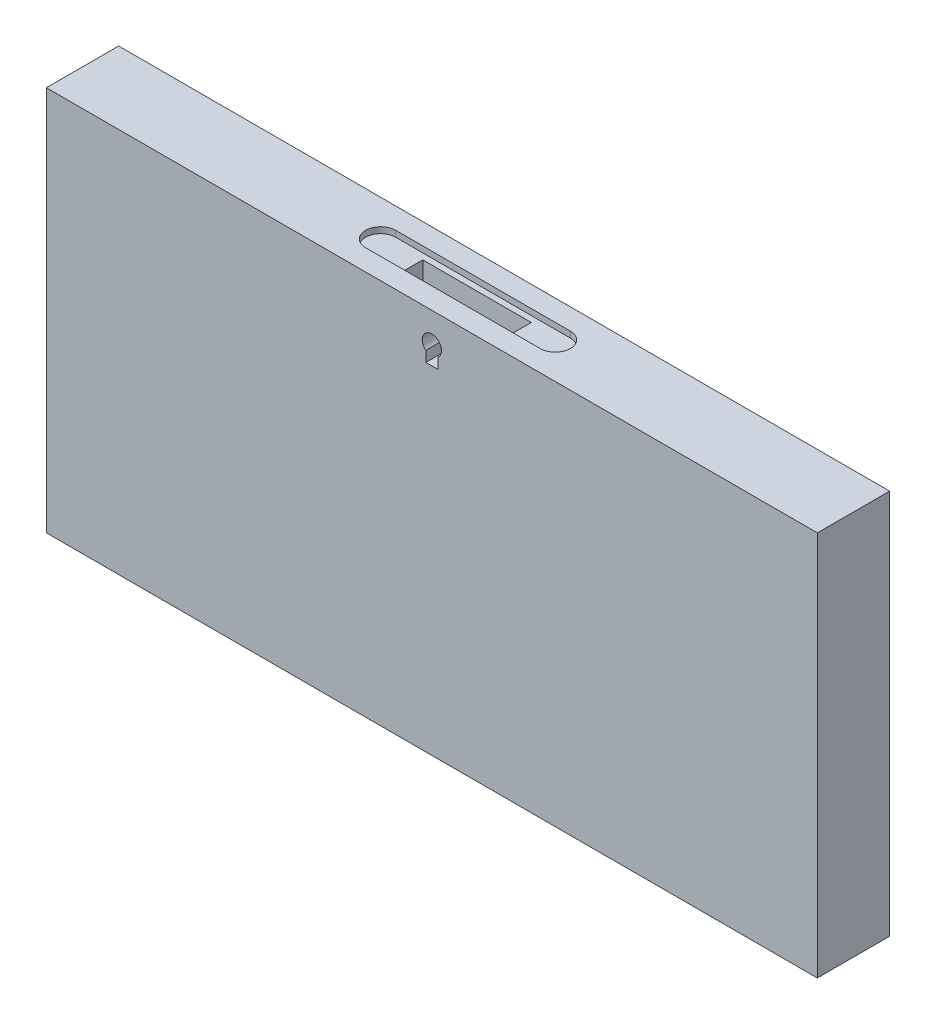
ISO-10303-21;
HEADER;
FILE_DESCRIPTION(('STEP AP214'),'2;1');
FILE_NAME('part.step','',(''),(''),'','','');
FILE_SCHEMA(('AUTOMOTIVE_DESIGN { 1 0 10303 214 1 1 1 1 }'));
ENDSEC;
DATA;
#1=APPLICATION_CONTEXT('core data for automotive mechanical design processes');
#2=APPLICATION_PROTOCOL_DEFINITION('international standard','automotive_design',2000,#1);
#3=PRODUCT_CONTEXT('',#1,'mechanical');
#4=PRODUCT('Part','Part','',(#3));
#5=PRODUCT_RELATED_PRODUCT_CATEGORY('part','',(#4));
#6=PRODUCT_DEFINITION_FORMATION('','',#4);
#7=PRODUCT_DEFINITION_CONTEXT('part definition',#1,'design');
#8=PRODUCT_DEFINITION('design','',#6,#7);
#9=PRODUCT_DEFINITION_SHAPE('','',#8);
#10=(LENGTH_UNIT() NAMED_UNIT(*) SI_UNIT(.MILLI.,.METRE.));
#11=(NAMED_UNIT(*) PLANE_ANGLE_UNIT() SI_UNIT($,.RADIAN.));
#12=(NAMED_UNIT(*) SI_UNIT($,.STERADIAN.) SOLID_ANGLE_UNIT());
#13=UNCERTAINTY_MEASURE_WITH_UNIT(LENGTH_MEASURE(1.E-05),#10,'distance_accuracy_value','');
#14=(GEOMETRIC_REPRESENTATION_CONTEXT(3) GLOBAL_UNCERTAINTY_ASSIGNED_CONTEXT((#13)) GLOBAL_UNIT_ASSIGNED_CONTEXT((#10,
#11,#12)) REPRESENTATION_CONTEXT('',''));
#15=CARTESIAN_POINT('',(0.,0.,0.));
#16=DIRECTION('',(0.,0.,1.));
#17=DIRECTION('',(1.,0.,0.));
#18=AXIS2_PLACEMENT_3D('',#15,#16,#17);
#19=CARTESIAN_POINT('',(0.,-101.6,0.));
#20=DIRECTION('',(-1.,0.,0.));
#21=DIRECTION('',(0.,0.,1.));
#22=AXIS2_PLACEMENT_3D('',#19,#20,#21);
#23=PLANE('',#22);
#24=DIRECTION('',(0.,0.,1.));
#25=VECTOR('',#24,1.);
#26=CARTESIAN_POINT('',(0.,0.,0.));
#27=LINE('',#26,#25);
#28=CARTESIAN_POINT('',(0.,0.,-19.05));
#29=VERTEX_POINT('',#28);
#30=CARTESIAN_POINT('',(0.,0.,0.));
#31=VERTEX_POINT('',#30);
#32=EDGE_CURVE('E229',#29,#31,#27,.T.);
#33=ORIENTED_EDGE('',*,*,#32,.F.);
#34=DIRECTION('',(0.,1.,0.));
#35=VECTOR('',#34,1.);
#36=CARTESIAN_POINT('',(0.,-101.6,-19.05));
#37=LINE('',#36,#35);
#38=CARTESIAN_POINT('',(0.,-101.6,-19.05));
#39=VERTEX_POINT('',#38);
#40=EDGE_CURVE('E260',#39,#29,#37,.T.);
#41=ORIENTED_EDGE('',*,*,#40,.F.);
#42=DIRECTION('',(0.,0.,1.));
#43=VECTOR('',#42,1.);
#44=CARTESIAN_POINT('',(0.,-101.6,0.));
#45=LINE('',#44,#43);
#46=CARTESIAN_POINT('',(0.,-101.6,0.));
#47=VERTEX_POINT('',#46);
#48=EDGE_CURVE('E236',#39,#47,#45,.T.);
#49=ORIENTED_EDGE('',*,*,#48,.T.);
#50=DIRECTION('',(0.,1.,0.));
#51=VECTOR('',#50,1.);
#52=CARTESIAN_POINT('',(0.,-101.6,0.));
#53=LINE('',#52,#51);
#54=EDGE_CURVE('E249',#47,#31,#53,.T.);
#55=ORIENTED_EDGE('',*,*,#54,.T.);
#56=EDGE_LOOP('',(#33,#41,#49,#55));
#57=FACE_BOUND('',#56,.T.);
#58=ADVANCED_FACE('F32',(#57),#23,.T.);
#59=CARTESIAN_POINT('',(0.,-101.6,-19.05));
#60=DIRECTION('',(0.,0.,-1.));
#61=DIRECTION('',(-1.,0.,0.));
#62=AXIS2_PLACEMENT_3D('',#59,#60,#61);
#63=PLANE('',#62);
#64=DIRECTION('',(-1.,0.,0.));
#65=VECTOR('',#64,1.);
#66=CARTESIAN_POINT('',(0.,0.,-19.05));
#67=LINE('',#66,#65);
#68=CARTESIAN_POINT('',(203.2,0.,-19.05));
#69=VERTEX_POINT('',#68);
#70=EDGE_CURVE('E240',#69,#29,#67,.T.);
#71=ORIENTED_EDGE('',*,*,#70,.F.);
#72=DIRECTION('',(0.,1.,0.));
#73=VECTOR('',#72,1.);
#74=CARTESIAN_POINT('',(203.2,-101.6,-19.05));
#75=LINE('',#74,#73);
#76=CARTESIAN_POINT('',(203.2,-101.6,-19.05));
#77=VERTEX_POINT('',#76);
#78=EDGE_CURVE('E263',#77,#69,#75,.T.);
#79=ORIENTED_EDGE('',*,*,#78,.F.);
#80=DIRECTION('',(-1.,0.,0.));
#81=VECTOR('',#80,1.);
#82=CARTESIAN_POINT('',(0.,-101.6,-19.05));
#83=LINE('',#82,#81);
#84=EDGE_CURVE('E246',#77,#39,#83,.T.);
#85=ORIENTED_EDGE('',*,*,#84,.T.);
#86=ORIENTED_EDGE('',*,*,#40,.T.);
#87=EDGE_LOOP('',(#71,#79,#85,#86));
#88=FACE_BOUND('',#87,.T.);
#89=ADVANCED_FACE('F290',(#88),#63,.T.);
#90=CARTESIAN_POINT('',(203.2,-101.6,0.));
#91=DIRECTION('',(1.,0.,0.));
#92=DIRECTION('',(0.,0.,-1.));
#93=AXIS2_PLACEMENT_3D('',#90,#91,#92);
#94=PLANE('',#93);
#95=DIRECTION('',(0.,0.,-1.));
#96=VECTOR('',#95,1.);
#97=CARTESIAN_POINT('',(203.2,0.,0.));
#98=LINE('',#97,#96);
#99=CARTESIAN_POINT('',(203.2,0.,0.));
#100=VERTEX_POINT('',#99);
#101=EDGE_CURVE('E255',#100,#69,#98,.T.);
#102=ORIENTED_EDGE('',*,*,#101,.F.);
#103=DIRECTION('',(0.,1.,0.));
#104=VECTOR('',#103,1.);
#105=CARTESIAN_POINT('',(203.2,-101.6,0.));
#106=LINE('',#105,#104);
#107=CARTESIAN_POINT('',(203.2,-101.6,0.));
#108=VERTEX_POINT('',#107);
#109=EDGE_CURVE('E265',#108,#100,#106,.T.);
#110=ORIENTED_EDGE('',*,*,#109,.F.);
#111=DIRECTION('',(0.,0.,-1.));
#112=VECTOR('',#111,1.);
#113=CARTESIAN_POINT('',(203.2,-101.6,0.));
#114=LINE('',#113,#112);
#115=EDGE_CURVE('E243',#108,#77,#114,.T.);
#116=ORIENTED_EDGE('',*,*,#115,.T.);
#117=ORIENTED_EDGE('',*,*,#78,.T.);
#118=EDGE_LOOP('',(#102,#110,#116,#117));
#119=FACE_BOUND('',#118,.T.);
#120=ADVANCED_FACE('F295',(#119),#94,.T.);
#121=CARTESIAN_POINT('',(0.,-101.6,0.));
#122=DIRECTION('',(0.,0.,1.));
#123=DIRECTION('',(1.,0.,0.));
#124=AXIS2_PLACEMENT_3D('',#121,#122,#123);
#125=PLANE('',#124);
#126=DIRECTION('',(0.,-1.,0.));
#127=VECTOR('',#126,1.);
#128=CARTESIAN_POINT('',(100.0125,-9.92028686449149,0.));
#129=LINE('',#128,#127);
#130=CARTESIAN_POINT('',(100.0125,-9.92028686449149,0.));
#131=VERTEX_POINT('',#130);
#132=CARTESIAN_POINT('',(100.0125,-12.7,0.));
#133=VERTEX_POINT('',#132);
#134=EDGE_CURVE('E162',#131,#133,#129,.T.);
#135=ORIENTED_EDGE('',*,*,#134,.F.);
#136=CARTESIAN_POINT('',(101.6,-7.9375,0.));
#137=DIRECTION('',(0.,0.,1.));
#138=DIRECTION('',(1.,0.,0.));
#139=AXIS2_PLACEMENT_3D('',#136,#137,#138);
#140=CIRCLE('',#139,2.54);
#141=CARTESIAN_POINT('',(103.1875,-9.92028686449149,0.));
#142=VERTEX_POINT('',#141);
#143=EDGE_CURVE('E147',#142,#131,#140,.T.);
#144=ORIENTED_EDGE('',*,*,#143,.F.);
#145=DIRECTION('',(0.,1.,0.));
#146=VECTOR('',#145,1.);
#147=CARTESIAN_POINT('',(103.1875,-12.7,0.));
#148=LINE('',#147,#146);
#149=CARTESIAN_POINT('',(103.1875,-12.7,0.));
#150=VERTEX_POINT('',#149);
#151=EDGE_CURVE('E155',#150,#142,#148,.T.);
#152=ORIENTED_EDGE('',*,*,#151,.F.);
#153=DIRECTION('',(1.,0.,0.));
#154=VECTOR('',#153,1.);
#155=CARTESIAN_POINT('',(100.0125,-12.7,0.));
#156=LINE('',#155,#154);
#157=EDGE_CURVE('E46',#133,#150,#156,.T.);
#158=ORIENTED_EDGE('',*,*,#157,.F.);
#159=EDGE_LOOP('',(#135,#144,#152,#158));
#160=FACE_BOUND('',#159,.T.);
#161=DIRECTION('',(1.,0.,0.));
#162=VECTOR('',#161,1.);
#163=CARTESIAN_POINT('',(0.,0.,0.));
#164=LINE('',#163,#162);
#165=EDGE_CURVE('E252',#31,#100,#164,.T.);
#166=ORIENTED_EDGE('',*,*,#165,.F.);
#167=ORIENTED_EDGE('',*,*,#54,.F.);
#168=DIRECTION('',(1.,0.,0.));
#169=VECTOR('',#168,1.);
#170=CARTESIAN_POINT('',(0.,-101.6,0.));
#171=LINE('',#170,#169);
#172=EDGE_CURVE('E239',#47,#108,#171,.T.);
#173=ORIENTED_EDGE('',*,*,#172,.T.);
#174=ORIENTED_EDGE('',*,*,#109,.T.);
#175=EDGE_LOOP('',(#166,#167,#173,#174));
#176=FACE_BOUND('',#175,.T.);
#177=ADVANCED_FACE('F159',(#160,#176),#125,.T.);
#178=CARTESIAN_POINT('',(0.,-101.6,-19.05));
#179=DIRECTION('',(0.,-1.,0.));
#180=DIRECTION('',(0.,0.,-1.));
#181=AXIS2_PLACEMENT_3D('',#178,#179,#180);
#182=PLANE('',#181);
#183=ORIENTED_EDGE('',*,*,#48,.F.);
#184=ORIENTED_EDGE('',*,*,#84,.F.);
#185=ORIENTED_EDGE('',*,*,#115,.F.);
#186=ORIENTED_EDGE('',*,*,#172,.F.);
#187=EDGE_LOOP('',(#183,#184,#185,#186));
#188=FACE_BOUND('',#187,.T.);
#189=ADVANCED_FACE('F308',(#188),#182,.T.);
#190=CARTESIAN_POINT('',(0.,0.,-19.05));
#191=DIRECTION('',(0.,-1.,0.));
#192=DIRECTION('',(0.,0.,-1.));
#193=AXIS2_PLACEMENT_3D('',#190,#191,#192);
#194=PLANE('',#193);
#195=DIRECTION('',(1.,0.,0.));
#196=VECTOR('',#195,1.);
#197=CARTESIAN_POINT('',(78.58125,0.,-5.55625));
#198=LINE('',#197,#196);
#199=CARTESIAN_POINT('',(78.58125,0.,-5.55625));
#200=VERTEX_POINT('',#199);
#201=CARTESIAN_POINT('',(124.61875,0.,-5.55625));
#202=VERTEX_POINT('',#201);
#203=EDGE_CURVE('E219',#200,#202,#198,.T.);
#204=ORIENTED_EDGE('',*,*,#203,.F.);
#205=CARTESIAN_POINT('',(78.58125,0.,-9.525));
#206=DIRECTION('',(0.,1.,0.));
#207=DIRECTION('',(0.,0.,1.));
#208=AXIS2_PLACEMENT_3D('',#205,#206,#207);
#209=CIRCLE('',#208,3.96875);
#210=CARTESIAN_POINT('',(78.58125,0.,-13.49375));
#211=VERTEX_POINT('',#210);
#212=EDGE_CURVE('E197',#211,#200,#209,.T.);
#213=ORIENTED_EDGE('',*,*,#212,.F.);
#214=DIRECTION('',(-1.,0.,0.));
#215=VECTOR('',#214,1.);
#216=CARTESIAN_POINT('',(124.61875,0.,-13.49375));
#217=LINE('',#216,#215);
#218=CARTESIAN_POINT('',(124.61875,0.,-13.49375));
#219=VERTEX_POINT('',#218);
#220=EDGE_CURVE('E208',#219,#211,#217,.T.);
#221=ORIENTED_EDGE('',*,*,#220,.F.);
#222=CARTESIAN_POINT('',(124.61875,0.,-9.525));
#223=DIRECTION('',(0.,1.,0.));
#224=DIRECTION('',(0.,0.,1.));
#225=AXIS2_PLACEMENT_3D('',#222,#223,#224);
#226=CIRCLE('',#225,3.96875);
#227=EDGE_CURVE('E222',#202,#219,#226,.T.);
#228=ORIENTED_EDGE('',*,*,#227,.F.);
#229=EDGE_LOOP('',(#204,#213,#221,#228));
#230=FACE_BOUND('',#229,.T.);
#231=ORIENTED_EDGE('',*,*,#32,.T.);
#232=ORIENTED_EDGE('',*,*,#165,.T.);
#233=ORIENTED_EDGE('',*,*,#101,.T.);
#234=ORIENTED_EDGE('',*,*,#70,.T.);
#235=EDGE_LOOP('',(#231,#232,#233,#234));
#236=FACE_BOUND('',#235,.T.);
#237=ADVANCED_FACE('F303',(#230,#236),#194,.F.);
#238=CARTESIAN_POINT('',(78.58125,-1.5875,-9.525));
#239=DIRECTION('',(0.,1.,0.));
#240=DIRECTION('',(0.,0.,1.));
#241=AXIS2_PLACEMENT_3D('',#238,#239,#240);
#242=CYLINDRICAL_SURFACE('',#241,3.96875);
#243=ORIENTED_EDGE('',*,*,#212,.T.);
#244=DIRECTION('',(0.,1.,0.));
#245=VECTOR('',#244,1.);
#246=CARTESIAN_POINT('',(78.58125,-1.5875,-5.55625));
#247=LINE('',#246,#245);
#248=CARTESIAN_POINT('',(78.58125,-1.5875,-5.55625));
#249=VERTEX_POINT('',#248);
#250=EDGE_CURVE('E217',#249,#200,#247,.T.);
#251=ORIENTED_EDGE('',*,*,#250,.F.);
#252=CARTESIAN_POINT('',(78.58125,-1.5875,-9.525));
#253=DIRECTION('',(0.,1.,0.));
#254=DIRECTION('',(0.,0.,1.));
#255=AXIS2_PLACEMENT_3D('',#252,#253,#254);
#256=CIRCLE('',#255,3.96875);
#257=CARTESIAN_POINT('',(78.58125,-1.5875,-13.49375));
#258=VERTEX_POINT('',#257);
#259=EDGE_CURVE('E204',#258,#249,#256,.T.);
#260=ORIENTED_EDGE('',*,*,#259,.F.);
#261=DIRECTION('',(0.,1.,0.));
#262=VECTOR('',#261,1.);
#263=CARTESIAN_POINT('',(78.58125,-1.5875,-13.49375));
#264=LINE('',#263,#262);
#265=EDGE_CURVE('E227',#258,#211,#264,.T.);
#266=ORIENTED_EDGE('',*,*,#265,.T.);
#267=EDGE_LOOP('',(#243,#251,#260,#266));
#268=FACE_BOUND('',#267,.T.);
#269=ADVANCED_FACE('F319',(#268),#242,.F.);
#270=CARTESIAN_POINT('',(124.61875,-1.5875,-13.49375));
#271=DIRECTION('',(0.,0.,-1.));
#272=DIRECTION('',(-1.,0.,0.));
#273=AXIS2_PLACEMENT_3D('',#270,#271,#272);
#274=PLANE('',#273);
#275=ORIENTED_EDGE('',*,*,#220,.T.);
#276=ORIENTED_EDGE('',*,*,#265,.F.);
#277=DIRECTION('',(-1.,0.,0.));
#278=VECTOR('',#277,1.);
#279=CARTESIAN_POINT('',(124.61875,-1.5875,-13.49375));
#280=LINE('',#279,#278);
#281=CARTESIAN_POINT('',(124.61875,-1.5875,-13.49375));
#282=VERTEX_POINT('',#281);
#283=EDGE_CURVE('E214',#282,#258,#280,.T.);
#284=ORIENTED_EDGE('',*,*,#283,.F.);
#285=DIRECTION('',(0.,1.,0.));
#286=VECTOR('',#285,1.);
#287=CARTESIAN_POINT('',(124.61875,-1.5875,-13.49375));
#288=LINE('',#287,#286);
#289=EDGE_CURVE('E230',#282,#219,#288,.T.);
#290=ORIENTED_EDGE('',*,*,#289,.T.);
#291=EDGE_LOOP('',(#275,#276,#284,#290));
#292=FACE_BOUND('',#291,.T.);
#293=ADVANCED_FACE('F325',(#292),#274,.F.);
#294=CARTESIAN_POINT('',(124.61875,-1.5875,-9.525));
#295=DIRECTION('',(0.,1.,0.));
#296=DIRECTION('',(0.,0.,1.));
#297=AXIS2_PLACEMENT_3D('',#294,#295,#296);
#298=CYLINDRICAL_SURFACE('',#297,3.96875);
#299=ORIENTED_EDGE('',*,*,#227,.T.);
#300=ORIENTED_EDGE('',*,*,#289,.F.);
#301=CARTESIAN_POINT('',(124.61875,-1.5875,-9.525));
#302=DIRECTION('',(0.,1.,0.));
#303=DIRECTION('',(0.,0.,1.));
#304=AXIS2_PLACEMENT_3D('',#301,#302,#303);
#305=CIRCLE('',#304,3.96875);
#306=CARTESIAN_POINT('',(124.61875,-1.5875,-5.55625));
#307=VERTEX_POINT('',#306);
#308=EDGE_CURVE('E211',#307,#282,#305,.T.);
#309=ORIENTED_EDGE('',*,*,#308,.F.);
#310=DIRECTION('',(0.,1.,0.));
#311=VECTOR('',#310,1.);
#312=CARTESIAN_POINT('',(124.61875,-1.5875,-5.55625));
#313=LINE('',#312,#311);
#314=EDGE_CURVE('E232',#307,#202,#313,.T.);
#315=ORIENTED_EDGE('',*,*,#314,.T.);
#316=EDGE_LOOP('',(#299,#300,#309,#315));
#317=FACE_BOUND('',#316,.T.);
#318=ADVANCED_FACE('F331',(#317),#298,.F.);
#319=CARTESIAN_POINT('',(78.58125,-1.5875,-5.55625));
#320=DIRECTION('',(0.,0.,1.));
#321=DIRECTION('',(1.,0.,0.));
#322=AXIS2_PLACEMENT_3D('',#319,#320,#321);
#323=PLANE('',#322);
#324=ORIENTED_EDGE('',*,*,#203,.T.);
#325=ORIENTED_EDGE('',*,*,#314,.F.);
#326=DIRECTION('',(1.,0.,0.));
#327=VECTOR('',#326,1.);
#328=CARTESIAN_POINT('',(78.58125,-1.5875,-5.55625));
#329=LINE('',#328,#327);
#330=EDGE_CURVE('E207',#249,#307,#329,.T.);
#331=ORIENTED_EDGE('',*,*,#330,.F.);
#332=ORIENTED_EDGE('',*,*,#250,.T.);
#333=EDGE_LOOP('',(#324,#325,#331,#332));
#334=FACE_BOUND('',#333,.T.);
#335=ADVANCED_FACE('F327',(#334),#323,.F.);
#336=CARTESIAN_POINT('',(78.58125,-1.5875,-9.525));
#337=DIRECTION('',(0.,1.,0.));
#338=DIRECTION('',(0.,0.,1.));
#339=AXIS2_PLACEMENT_3D('',#336,#337,#338);
#340=PLANE('',#339);
#341=DIRECTION('',(-1.,0.,0.));
#342=VECTOR('',#341,1.);
#343=CARTESIAN_POINT('',(115.8875,-1.5875,-11.90625));
#344=LINE('',#343,#342);
#345=CARTESIAN_POINT('',(115.8875,-1.5875,-11.90625));
#346=VERTEX_POINT('',#345);
#347=CARTESIAN_POINT('',(87.3125,-1.5875,-11.90625));
#348=VERTEX_POINT('',#347);
#349=EDGE_CURVE('E185',#346,#348,#344,.T.);
#350=ORIENTED_EDGE('',*,*,#349,.F.);
#351=DIRECTION('',(0.,0.,-1.));
#352=VECTOR('',#351,1.);
#353=CARTESIAN_POINT('',(115.8875,-1.5875,-7.14375));
#354=LINE('',#353,#352);
#355=CARTESIAN_POINT('',(115.8875,-1.5875,-7.14375));
#356=VERTEX_POINT('',#355);
#357=EDGE_CURVE('E175',#356,#346,#354,.T.);
#358=ORIENTED_EDGE('',*,*,#357,.F.);
#359=DIRECTION('',(1.,0.,0.));
#360=VECTOR('',#359,1.);
#361=CARTESIAN_POINT('',(87.3125,-1.5875,-7.14375));
#362=LINE('',#361,#360);
#363=CARTESIAN_POINT('',(87.3125,-1.5875,-7.14375));
#364=VERTEX_POINT('',#363);
#365=EDGE_CURVE('E190',#364,#356,#362,.T.);
#366=ORIENTED_EDGE('',*,*,#365,.F.);
#367=DIRECTION('',(0.,0.,1.));
#368=VECTOR('',#367,1.);
#369=CARTESIAN_POINT('',(87.3125,-1.5875,-11.90625));
#370=LINE('',#369,#368);
#371=EDGE_CURVE('E187',#348,#364,#370,.T.);
#372=ORIENTED_EDGE('',*,*,#371,.F.);
#373=EDGE_LOOP('',(#350,#358,#366,#372));
#374=FACE_BOUND('',#373,.T.);
#375=ORIENTED_EDGE('',*,*,#259,.T.);
#376=ORIENTED_EDGE('',*,*,#330,.T.);
#377=ORIENTED_EDGE('',*,*,#308,.T.);
#378=ORIENTED_EDGE('',*,*,#283,.T.);
#379=EDGE_LOOP('',(#375,#376,#377,#378));
#380=FACE_BOUND('',#379,.T.);
#381=ADVANCED_FACE('F330',(#374,#380),#340,.T.);
#382=CARTESIAN_POINT('',(115.8875,-17.4625,-11.90625));
#383=DIRECTION('',(0.,0.,-1.));
#384=DIRECTION('',(-1.,0.,0.));
#385=AXIS2_PLACEMENT_3D('',#382,#383,#384);
#386=PLANE('',#385);
#387=ORIENTED_EDGE('',*,*,#349,.T.);
#388=DIRECTION('',(0.,1.,0.));
#389=VECTOR('',#388,1.);
#390=CARTESIAN_POINT('',(87.3125,-17.4625,-11.90625));
#391=LINE('',#390,#389);
#392=CARTESIAN_POINT('',(87.3125,-17.4625,-11.90625));
#393=VERTEX_POINT('',#392);
#394=EDGE_CURVE('E184',#393,#348,#391,.T.);
#395=ORIENTED_EDGE('',*,*,#394,.F.);
#396=DIRECTION('',(-1.,0.,0.));
#397=VECTOR('',#396,1.);
#398=CARTESIAN_POINT('',(115.8875,-17.4625,-11.90625));
#399=LINE('',#398,#397);
#400=CARTESIAN_POINT('',(115.8875,-17.4625,-11.90625));
#401=VERTEX_POINT('',#400);
#402=EDGE_CURVE('E171',#401,#393,#399,.T.);
#403=ORIENTED_EDGE('',*,*,#402,.F.);
#404=DIRECTION('',(0.,1.,0.));
#405=VECTOR('',#404,1.);
#406=CARTESIAN_POINT('',(115.8875,-17.4625,-11.90625));
#407=LINE('',#406,#405);
#408=EDGE_CURVE('E195',#401,#346,#407,.T.);
#409=ORIENTED_EDGE('',*,*,#408,.T.);
#410=EDGE_LOOP('',(#387,#395,#403,#409));
#411=FACE_BOUND('',#410,.T.);
#412=ADVANCED_FACE('F341',(#411),#386,.F.);
#413=CARTESIAN_POINT('',(115.8875,-17.4625,-7.14375));
#414=DIRECTION('',(1.,0.,0.));
#415=DIRECTION('',(0.,0.,-1.));
#416=AXIS2_PLACEMENT_3D('',#413,#414,#415);
#417=PLANE('',#416);
#418=ORIENTED_EDGE('',*,*,#357,.T.);
#419=ORIENTED_EDGE('',*,*,#408,.F.);
#420=DIRECTION('',(0.,0.,-1.));
#421=VECTOR('',#420,1.);
#422=CARTESIAN_POINT('',(115.8875,-17.4625,-7.14375));
#423=LINE('',#422,#421);
#424=CARTESIAN_POINT('',(115.8875,-17.4625,-7.14375));
#425=VERTEX_POINT('',#424);
#426=EDGE_CURVE('E181',#425,#401,#423,.T.);
#427=ORIENTED_EDGE('',*,*,#426,.F.);
#428=DIRECTION('',(0.,1.,0.));
#429=VECTOR('',#428,1.);
#430=CARTESIAN_POINT('',(115.8875,-17.4625,-7.14375));
#431=LINE('',#430,#429);
#432=EDGE_CURVE('E198',#425,#356,#431,.T.);
#433=ORIENTED_EDGE('',*,*,#432,.T.);
#434=EDGE_LOOP('',(#418,#419,#427,#433));
#435=FACE_BOUND('',#434,.T.);
#436=ADVANCED_FACE('F345',(#435),#417,.F.);
#437=CARTESIAN_POINT('',(87.3125,-17.4625,-7.14375));
#438=DIRECTION('',(0.,0.,1.));
#439=DIRECTION('',(1.,0.,0.));
#440=AXIS2_PLACEMENT_3D('',#437,#438,#439);
#441=PLANE('',#440);
#442=CARTESIAN_POINT('',(101.6,-7.9375,-7.14375000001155));
#443=DIRECTION('',(0.,0.,1.));
#444=DIRECTION('',(1.,0.,0.));
#445=AXIS2_PLACEMENT_3D('',#442,#443,#444);
#446=CIRCLE('',#445,2.54);
#447=CARTESIAN_POINT('',(103.1875,-9.92028686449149,-7.14375));
#448=VERTEX_POINT('',#447);
#449=CARTESIAN_POINT('',(100.0125,-9.92028686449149,-7.14375000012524));
#450=VERTEX_POINT('',#449);
#451=EDGE_CURVE('E39',#448,#450,#446,.T.);
#452=ORIENTED_EDGE('',*,*,#451,.T.);
#453=DIRECTION('',(0.,-1.,0.));
#454=VECTOR('',#453,1.);
#455=CARTESIAN_POINT('',(100.0125,-17.4625,-7.14375));
#456=LINE('',#455,#454);
#457=CARTESIAN_POINT('',(100.0125,-12.7,-7.14375000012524));
#458=VERTEX_POINT('',#457);
#459=EDGE_CURVE('E11',#450,#458,#456,.T.);
#460=ORIENTED_EDGE('',*,*,#459,.T.);
#461=DIRECTION('',(1.,0.,0.));
#462=VECTOR('',#461,1.);
#463=CARTESIAN_POINT('',(87.3125,-12.7,-7.14375));
#464=LINE('',#463,#462);
#465=CARTESIAN_POINT('',(103.1875,-12.7,-7.14375000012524));
#466=VERTEX_POINT('',#465);
#467=EDGE_CURVE('E269',#458,#466,#464,.T.);
#468=ORIENTED_EDGE('',*,*,#467,.T.);
#469=DIRECTION('',(0.,1.,0.));
#470=VECTOR('',#469,1.);
#471=CARTESIAN_POINT('',(103.1875,-17.4625,-7.14375));
#472=LINE('',#471,#470);
#473=EDGE_CURVE('E262',#466,#448,#472,.T.);
#474=ORIENTED_EDGE('',*,*,#473,.T.);
#475=EDGE_LOOP('',(#452,#460,#468,#474));
#476=FACE_BOUND('',#475,.T.);
#477=ORIENTED_EDGE('',*,*,#365,.T.);
#478=ORIENTED_EDGE('',*,*,#432,.F.);
#479=DIRECTION('',(1.,0.,0.));
#480=VECTOR('',#479,1.);
#481=CARTESIAN_POINT('',(87.3125,-17.4625,-7.14375));
#482=LINE('',#481,#480);
#483=CARTESIAN_POINT('',(87.3125,-17.4625,-7.14375));
#484=VERTEX_POINT('',#483);
#485=EDGE_CURVE('E178',#484,#425,#482,.T.);
#486=ORIENTED_EDGE('',*,*,#485,.F.);
#487=DIRECTION('',(0.,1.,0.));
#488=VECTOR('',#487,1.);
#489=CARTESIAN_POINT('',(87.3125,-17.4625,-7.14375));
#490=LINE('',#489,#488);
#491=EDGE_CURVE('E200',#484,#364,#490,.T.);
#492=ORIENTED_EDGE('',*,*,#491,.T.);
#493=EDGE_LOOP('',(#477,#478,#486,#492));
#494=FACE_BOUND('',#493,.T.);
#495=ADVANCED_FACE('F272',(#476,#494),#441,.F.);
#496=CARTESIAN_POINT('',(87.3125,-17.4625,-11.90625));
#497=DIRECTION('',(-1.,0.,0.));
#498=DIRECTION('',(0.,0.,1.));
#499=AXIS2_PLACEMENT_3D('',#496,#497,#498);
#500=PLANE('',#499);
#501=ORIENTED_EDGE('',*,*,#371,.T.);
#502=ORIENTED_EDGE('',*,*,#491,.F.);
#503=DIRECTION('',(0.,0.,1.));
#504=VECTOR('',#503,1.);
#505=CARTESIAN_POINT('',(87.3125,-17.4625,-11.90625));
#506=LINE('',#505,#504);
#507=EDGE_CURVE('E174',#393,#484,#506,.T.);
#508=ORIENTED_EDGE('',*,*,#507,.F.);
#509=ORIENTED_EDGE('',*,*,#394,.T.);
#510=EDGE_LOOP('',(#501,#502,#508,#509));
#511=FACE_BOUND('',#510,.T.);
#512=ADVANCED_FACE('F286',(#511),#500,.F.);
#513=CARTESIAN_POINT('',(87.3125,-17.4625,-11.90625));
#514=DIRECTION('',(0.,1.,0.));
#515=DIRECTION('',(0.,0.,1.));
#516=AXIS2_PLACEMENT_3D('',#513,#514,#515);
#517=PLANE('',#516);
#518=ORIENTED_EDGE('',*,*,#402,.T.);
#519=ORIENTED_EDGE('',*,*,#507,.T.);
#520=ORIENTED_EDGE('',*,*,#485,.T.);
#521=ORIENTED_EDGE('',*,*,#426,.T.);
#522=EDGE_LOOP('',(#518,#519,#520,#521));
#523=FACE_BOUND('',#522,.T.);
#524=ADVANCED_FACE('F279',(#523),#517,.T.);
#525=CARTESIAN_POINT('',(100.0125,-9.92028686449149,-500000.));
#526=DIRECTION('',(-1.,0.,0.));
#527=DIRECTION('',(0.,0.,1.));
#528=AXIS2_PLACEMENT_3D('',#525,#526,#527);
#529=PLANE('',#528);
#530=DIRECTION('',(0.,0.,1.));
#531=VECTOR('',#530,1.);
#532=CARTESIAN_POINT('',(100.0125,-9.92028686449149,-500000.));
#533=LINE('',#532,#531);
#534=EDGE_CURVE('E151',#450,#131,#533,.T.);
#535=ORIENTED_EDGE('',*,*,#534,.T.);
#536=ORIENTED_EDGE('',*,*,#134,.T.);
#537=DIRECTION('',(0.,0.,1.));
#538=VECTOR('',#537,1.);
#539=CARTESIAN_POINT('',(100.0125,-12.7,-500000.));
#540=LINE('',#539,#538);
#541=EDGE_CURVE('E164',#458,#133,#540,.T.);
#542=ORIENTED_EDGE('',*,*,#541,.F.);
#543=ORIENTED_EDGE('',*,*,#459,.F.);
#544=EDGE_LOOP('',(#535,#536,#542,#543));
#545=FACE_BOUND('',#544,.T.);
#546=ADVANCED_FACE('F277',(#545),#529,.F.);
#547=CARTESIAN_POINT('',(101.6,-7.9375,-500000.));
#548=DIRECTION('',(0.,0.,1.));
#549=DIRECTION('',(1.,0.,0.));
#550=AXIS2_PLACEMENT_3D('',#547,#548,#549);
#551=CYLINDRICAL_SURFACE('',#550,2.54);
#552=DIRECTION('',(0.,0.,1.));
#553=VECTOR('',#552,1.);
#554=CARTESIAN_POINT('',(103.1875,-9.92028686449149,-500000.));
#555=LINE('',#554,#553);
#556=EDGE_CURVE('E54',#448,#142,#555,.T.);
#557=ORIENTED_EDGE('',*,*,#556,.T.);
#558=ORIENTED_EDGE('',*,*,#143,.T.);
#559=ORIENTED_EDGE('',*,*,#534,.F.);
#560=ORIENTED_EDGE('',*,*,#451,.F.);
#561=EDGE_LOOP('',(#557,#558,#559,#560));
#562=FACE_BOUND('',#561,.T.);
#563=ADVANCED_FACE('F144',(#562),#551,.F.);
#564=CARTESIAN_POINT('',(100.0125,-12.7,-500000.));
#565=DIRECTION('',(0.,-1.,0.));
#566=DIRECTION('',(0.,0.,-1.));
#567=AXIS2_PLACEMENT_3D('',#564,#565,#566);
#568=PLANE('',#567);
#569=ORIENTED_EDGE('',*,*,#541,.T.);
#570=ORIENTED_EDGE('',*,*,#157,.T.);
#571=DIRECTION('',(0.,0.,1.));
#572=VECTOR('',#571,1.);
#573=CARTESIAN_POINT('',(103.1875,-12.7,-500000.));
#574=LINE('',#573,#572);
#575=EDGE_CURVE('E152',#466,#150,#574,.T.);
#576=ORIENTED_EDGE('',*,*,#575,.F.);
#577=ORIENTED_EDGE('',*,*,#467,.F.);
#578=EDGE_LOOP('',(#569,#570,#576,#577));
#579=FACE_BOUND('',#578,.T.);
#580=ADVANCED_FACE('F274',(#579),#568,.F.);
#581=CARTESIAN_POINT('',(103.1875,-12.7,-500000.));
#582=DIRECTION('',(1.,0.,0.));
#583=DIRECTION('',(0.,0.,-1.));
#584=AXIS2_PLACEMENT_3D('',#581,#582,#583);
#585=PLANE('',#584);
#586=ORIENTED_EDGE('',*,*,#575,.T.);
#587=ORIENTED_EDGE('',*,*,#151,.T.);
#588=ORIENTED_EDGE('',*,*,#556,.F.);
#589=ORIENTED_EDGE('',*,*,#473,.F.);
#590=EDGE_LOOP('',(#586,#587,#588,#589));
#591=FACE_BOUND('',#590,.T.);
#592=ADVANCED_FACE('F156',(#591),#585,.F.);
#593=CLOSED_SHELL('',(#58,#89,#120,#177,#189,#237,#269,#293,#318,#335,#381,#412,#436,#495,#512,
#524,#546,#563,#580,#592));
#594=MANIFOLD_SOLID_BREP('B2',#593);
#595=ADVANCED_BREP_SHAPE_REPRESENTATION('',(#18,#594),#14);
#596=SHAPE_DEFINITION_REPRESENTATION(#9,#595);
ENDSEC;
END-ISO-10303-21;
